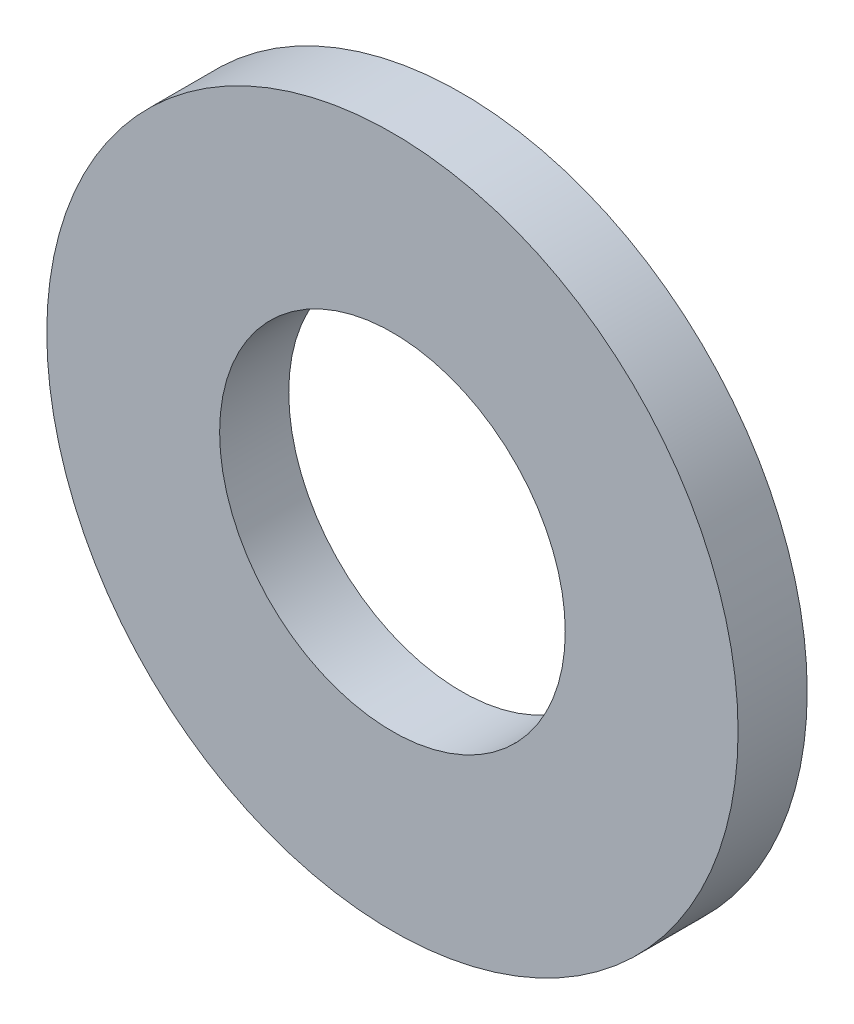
from build123d import *

# Parameters (mm, degrees)
ESQUISSE1_R          = 5
ESQUISSE1_R_2        = 2.5
BASE_EXTRUSION_DEPTH = 1


with BuildPart() as part:
    # Esquisse1 → Base-Extrusion (new body)
    with BuildSketch(Plane.XY):
        Circle(ESQUISSE1_R)
        Circle(ESQUISSE1_R_2, mode=Mode.SUBTRACT)
    extrude(amount=BASE_EXTRUSION_DEPTH)


solid = part.part
